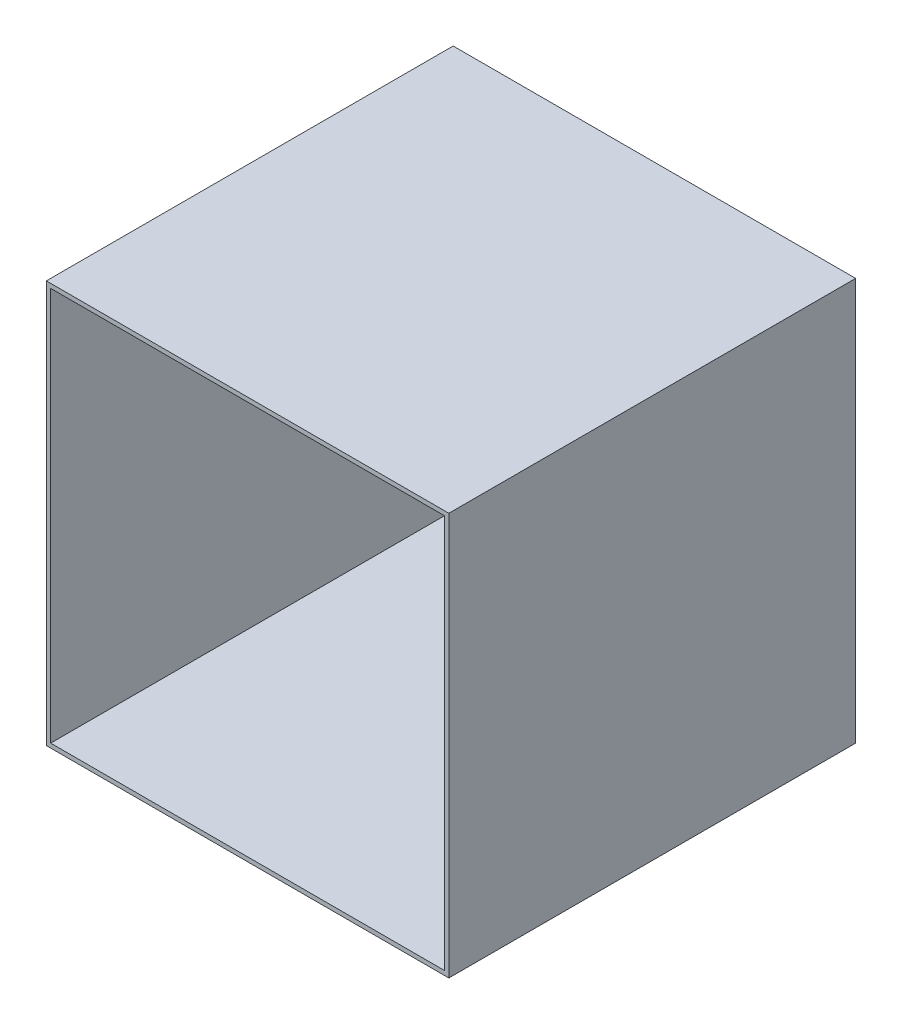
from build123d import *

# Parameters (mm, degrees)
SKETCH1_W           = 279.4
SKETCH1_H           = 279.4
BOSS_EXTRUDE1_DEPTH = 3
SKETCH2_W           = 279.4
SKETCH2_H           = 279.4
SKETCH2_W_2         = 273.4
SKETCH2_H_2         = 273.4
BOSS_EXTRUDE2_DEPTH = 279.4


with BuildPart() as part:
    # Sketch1 → Boss-Extrude1 (new body)
    with BuildSketch(Plane(origin=(0, 0, 0), x_dir=(0, 1, 0), z_dir=(0, 0, 1))):
        Rectangle(SKETCH1_W, SKETCH1_H)
    extrude(amount=BOSS_EXTRUDE1_DEPTH)

    # Sketch2 → Boss-Extrude2 (add)
    with BuildSketch(Plane.XY.offset(3)):
        Rectangle(SKETCH2_W, SKETCH2_H)
        Rectangle(SKETCH2_W_2, SKETCH2_H_2, mode=Mode.SUBTRACT)
    extrude(amount=BOSS_EXTRUDE2_DEPTH)


solid = part.part
